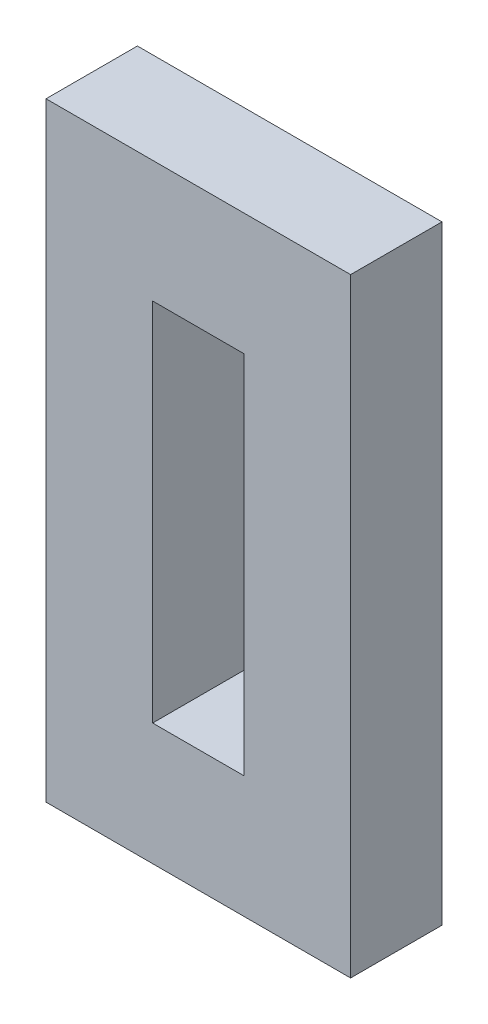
ISO-10303-21;
HEADER;
FILE_DESCRIPTION(('STEP AP214'),'2;1');
FILE_NAME('part.step','',(''),(''),'','','');
FILE_SCHEMA(('AUTOMOTIVE_DESIGN { 1 0 10303 214 1 1 1 1 }'));
ENDSEC;
DATA;
#1=APPLICATION_CONTEXT('core data for automotive mechanical design processes');
#2=APPLICATION_PROTOCOL_DEFINITION('international standard','automotive_design',2000,#1);
#3=PRODUCT_CONTEXT('',#1,'mechanical');
#4=PRODUCT('Part','Part','',(#3));
#5=PRODUCT_RELATED_PRODUCT_CATEGORY('part','',(#4));
#6=PRODUCT_DEFINITION_FORMATION('','',#4);
#7=PRODUCT_DEFINITION_CONTEXT('part definition',#1,'design');
#8=PRODUCT_DEFINITION('design','',#6,#7);
#9=PRODUCT_DEFINITION_SHAPE('','',#8);
#10=(LENGTH_UNIT() NAMED_UNIT(*) SI_UNIT(.MILLI.,.METRE.));
#11=(NAMED_UNIT(*) PLANE_ANGLE_UNIT() SI_UNIT($,.RADIAN.));
#12=(NAMED_UNIT(*) SI_UNIT($,.STERADIAN.) SOLID_ANGLE_UNIT());
#13=UNCERTAINTY_MEASURE_WITH_UNIT(LENGTH_MEASURE(1.E-05),#10,'distance_accuracy_value','');
#14=(GEOMETRIC_REPRESENTATION_CONTEXT(3) GLOBAL_UNCERTAINTY_ASSIGNED_CONTEXT((#13)) GLOBAL_UNIT_ASSIGNED_CONTEXT((#10,
#11,#12)) REPRESENTATION_CONTEXT('',''));
#15=CARTESIAN_POINT('',(0.,0.,0.));
#16=DIRECTION('',(0.,0.,1.));
#17=DIRECTION('',(1.,0.,0.));
#18=AXIS2_PLACEMENT_3D('',#15,#16,#17);
#19=CARTESIAN_POINT('',(0.,20.,3.));
#20=DIRECTION('',(0.,0.,-1.));
#21=DIRECTION('',(-1.,0.,0.));
#22=AXIS2_PLACEMENT_3D('',#19,#20,#21);
#23=PLANE('',#22);
#24=DIRECTION('',(0.,-1.,0.));
#25=VECTOR('',#24,1.);
#26=CARTESIAN_POINT('',(0.,0.,3.));
#27=LINE('',#26,#25);
#28=CARTESIAN_POINT('',(0.,20.,3.));
#29=VERTEX_POINT('',#28);
#30=CARTESIAN_POINT('',(0.,0.,3.));
#31=VERTEX_POINT('',#30);
#32=EDGE_CURVE('E140',#29,#31,#27,.T.);
#33=ORIENTED_EDGE('',*,*,#32,.T.);
#34=DIRECTION('',(1.,0.,0.));
#35=VECTOR('',#34,1.);
#36=CARTESIAN_POINT('',(0.,0.,3.));
#37=LINE('',#36,#35);
#38=CARTESIAN_POINT('',(10.,0.,3.));
#39=VERTEX_POINT('',#38);
#40=EDGE_CURVE('E143',#31,#39,#37,.T.);
#41=ORIENTED_EDGE('',*,*,#40,.T.);
#42=DIRECTION('',(0.,1.,0.));
#43=VECTOR('',#42,1.);
#44=CARTESIAN_POINT('',(10.,0.,3.));
#45=LINE('',#44,#43);
#46=CARTESIAN_POINT('',(10.,20.,3.));
#47=VERTEX_POINT('',#46);
#48=EDGE_CURVE('E145',#39,#47,#45,.T.);
#49=ORIENTED_EDGE('',*,*,#48,.T.);
#50=DIRECTION('',(-1.,0.,0.));
#51=VECTOR('',#50,1.);
#52=CARTESIAN_POINT('',(0.,20.,3.));
#53=LINE('',#52,#51);
#54=EDGE_CURVE('E147',#47,#29,#53,.T.);
#55=ORIENTED_EDGE('',*,*,#54,.T.);
#56=EDGE_LOOP('',(#33,#41,#49,#55));
#57=FACE_BOUND('',#56,.T.);
#58=DIRECTION('',(0.,-1.,0.));
#59=VECTOR('',#58,1.);
#60=CARTESIAN_POINT('',(3.5,16.,3.));
#61=LINE('',#60,#59);
#62=CARTESIAN_POINT('',(3.5,16.,3.));
#63=VERTEX_POINT('',#62);
#64=CARTESIAN_POINT('',(3.5,4.,3.));
#65=VERTEX_POINT('',#64);
#66=EDGE_CURVE('E111',#63,#65,#61,.T.);
#67=ORIENTED_EDGE('',*,*,#66,.F.);
#68=DIRECTION('',(-1.,0.,0.));
#69=VECTOR('',#68,1.);
#70=CARTESIAN_POINT('',(3.5,16.,3.));
#71=LINE('',#70,#69);
#72=CARTESIAN_POINT('',(6.5,16.,3.));
#73=VERTEX_POINT('',#72);
#74=EDGE_CURVE('E126',#73,#63,#71,.T.);
#75=ORIENTED_EDGE('',*,*,#74,.F.);
#76=DIRECTION('',(0.,1.,0.));
#77=VECTOR('',#76,1.);
#78=CARTESIAN_POINT('',(6.5,16.,3.));
#79=LINE('',#78,#77);
#80=CARTESIAN_POINT('',(6.5,4.,3.));
#81=VERTEX_POINT('',#80);
#82=EDGE_CURVE('E124',#81,#73,#79,.T.);
#83=ORIENTED_EDGE('',*,*,#82,.F.);
#84=DIRECTION('',(1.,0.,0.));
#85=VECTOR('',#84,1.);
#86=CARTESIAN_POINT('',(3.5,4.,3.));
#87=LINE('',#86,#85);
#88=EDGE_CURVE('E122',#65,#81,#87,.T.);
#89=ORIENTED_EDGE('',*,*,#88,.F.);
#90=EDGE_LOOP('',(#67,#75,#83,#89));
#91=FACE_BOUND('',#90,.T.);
#92=ADVANCED_FACE('F31',(#57,#91),#23,.F.);
#93=CARTESIAN_POINT('',(0.,20.,0.));
#94=DIRECTION('',(0.,0.,-1.));
#95=DIRECTION('',(-1.,0.,0.));
#96=AXIS2_PLACEMENT_3D('',#93,#94,#95);
#97=PLANE('',#96);
#98=DIRECTION('',(0.,-1.,0.));
#99=VECTOR('',#98,1.);
#100=CARTESIAN_POINT('',(0.,0.,0.));
#101=LINE('',#100,#99);
#102=CARTESIAN_POINT('',(0.,20.,0.));
#103=VERTEX_POINT('',#102);
#104=CARTESIAN_POINT('',(0.,0.,0.));
#105=VERTEX_POINT('',#104);
#106=EDGE_CURVE('E112',#103,#105,#101,.T.);
#107=ORIENTED_EDGE('',*,*,#106,.F.);
#108=DIRECTION('',(-1.,0.,0.));
#109=VECTOR('',#108,1.);
#110=CARTESIAN_POINT('',(0.,20.,0.));
#111=LINE('',#110,#109);
#112=CARTESIAN_POINT('',(10.,20.,0.));
#113=VERTEX_POINT('',#112);
#114=EDGE_CURVE('E138',#113,#103,#111,.T.);
#115=ORIENTED_EDGE('',*,*,#114,.F.);
#116=DIRECTION('',(0.,1.,0.));
#117=VECTOR('',#116,1.);
#118=CARTESIAN_POINT('',(10.,0.,0.));
#119=LINE('',#118,#117);
#120=CARTESIAN_POINT('',(10.,0.,0.));
#121=VERTEX_POINT('',#120);
#122=EDGE_CURVE('E136',#121,#113,#119,.T.);
#123=ORIENTED_EDGE('',*,*,#122,.F.);
#124=DIRECTION('',(1.,0.,0.));
#125=VECTOR('',#124,1.);
#126=CARTESIAN_POINT('',(0.,0.,0.));
#127=LINE('',#126,#125);
#128=EDGE_CURVE('E134',#105,#121,#127,.T.);
#129=ORIENTED_EDGE('',*,*,#128,.F.);
#130=EDGE_LOOP('',(#107,#115,#123,#129));
#131=FACE_BOUND('',#130,.T.);
#132=DIRECTION('',(-1.,0.,0.));
#133=VECTOR('',#132,1.);
#134=CARTESIAN_POINT('',(3.5,16.,0.));
#135=LINE('',#134,#133);
#136=CARTESIAN_POINT('',(6.5,16.,0.));
#137=VERTEX_POINT('',#136);
#138=CARTESIAN_POINT('',(3.5,16.,0.));
#139=VERTEX_POINT('',#138);
#140=EDGE_CURVE('E116',#137,#139,#135,.T.);
#141=ORIENTED_EDGE('',*,*,#140,.T.);
#142=DIRECTION('',(0.,-1.,0.));
#143=VECTOR('',#142,1.);
#144=CARTESIAN_POINT('',(3.5,16.,0.));
#145=LINE('',#144,#143);
#146=CARTESIAN_POINT('',(3.5,4.,0.));
#147=VERTEX_POINT('',#146);
#148=EDGE_CURVE('E54',#139,#147,#145,.T.);
#149=ORIENTED_EDGE('',*,*,#148,.T.);
#150=DIRECTION('',(1.,0.,0.));
#151=VECTOR('',#150,1.);
#152=CARTESIAN_POINT('',(3.5,4.,0.));
#153=LINE('',#152,#151);
#154=CARTESIAN_POINT('',(6.5,4.,0.));
#155=VERTEX_POINT('',#154);
#156=EDGE_CURVE('E98',#147,#155,#153,.T.);
#157=ORIENTED_EDGE('',*,*,#156,.T.);
#158=DIRECTION('',(0.,1.,0.));
#159=VECTOR('',#158,1.);
#160=CARTESIAN_POINT('',(6.5,16.,0.));
#161=LINE('',#160,#159);
#162=EDGE_CURVE('E107',#155,#137,#161,.T.);
#163=ORIENTED_EDGE('',*,*,#162,.T.);
#164=EDGE_LOOP('',(#141,#149,#157,#163));
#165=FACE_BOUND('',#164,.T.);
#166=ADVANCED_FACE('F115',(#131,#165),#97,.T.);
#167=CARTESIAN_POINT('',(0.,0.,3.));
#168=DIRECTION('',(1.,0.,0.));
#169=DIRECTION('',(0.,0.,-1.));
#170=AXIS2_PLACEMENT_3D('',#167,#168,#169);
#171=PLANE('',#170);
#172=ORIENTED_EDGE('',*,*,#106,.T.);
#173=DIRECTION('',(0.,0.,-1.));
#174=VECTOR('',#173,1.);
#175=CARTESIAN_POINT('',(0.,0.,3.));
#176=LINE('',#175,#174);
#177=EDGE_CURVE('E11',#31,#105,#176,.T.);
#178=ORIENTED_EDGE('',*,*,#177,.F.);
#179=ORIENTED_EDGE('',*,*,#32,.F.);
#180=DIRECTION('',(0.,0.,-1.));
#181=VECTOR('',#180,1.);
#182=CARTESIAN_POINT('',(0.,20.,3.));
#183=LINE('',#182,#181);
#184=EDGE_CURVE('E149',#29,#103,#183,.T.);
#185=ORIENTED_EDGE('',*,*,#184,.T.);
#186=EDGE_LOOP('',(#172,#178,#179,#185));
#187=FACE_BOUND('',#186,.T.);
#188=ADVANCED_FACE('F33',(#187),#171,.F.);
#189=CARTESIAN_POINT('',(0.,0.,3.));
#190=DIRECTION('',(0.,1.,0.));
#191=DIRECTION('',(0.,0.,1.));
#192=AXIS2_PLACEMENT_3D('',#189,#190,#191);
#193=PLANE('',#192);
#194=ORIENTED_EDGE('',*,*,#128,.T.);
#195=DIRECTION('',(0.,0.,-1.));
#196=VECTOR('',#195,1.);
#197=CARTESIAN_POINT('',(10.,0.,3.));
#198=LINE('',#197,#196);
#199=EDGE_CURVE('E39',#39,#121,#198,.T.);
#200=ORIENTED_EDGE('',*,*,#199,.F.);
#201=ORIENTED_EDGE('',*,*,#40,.F.);
#202=ORIENTED_EDGE('',*,*,#177,.T.);
#203=EDGE_LOOP('',(#194,#200,#201,#202));
#204=FACE_BOUND('',#203,.T.);
#205=ADVANCED_FACE('F174',(#204),#193,.F.);
#206=CARTESIAN_POINT('',(10.,0.,3.));
#207=DIRECTION('',(-1.,0.,0.));
#208=DIRECTION('',(0.,0.,1.));
#209=AXIS2_PLACEMENT_3D('',#206,#207,#208);
#210=PLANE('',#209);
#211=ORIENTED_EDGE('',*,*,#122,.T.);
#212=DIRECTION('',(0.,0.,-1.));
#213=VECTOR('',#212,1.);
#214=CARTESIAN_POINT('',(10.,20.,3.));
#215=LINE('',#214,#213);
#216=EDGE_CURVE('E152',#47,#113,#215,.T.);
#217=ORIENTED_EDGE('',*,*,#216,.F.);
#218=ORIENTED_EDGE('',*,*,#48,.F.);
#219=ORIENTED_EDGE('',*,*,#199,.T.);
#220=EDGE_LOOP('',(#211,#217,#218,#219));
#221=FACE_BOUND('',#220,.T.);
#222=ADVANCED_FACE('F159',(#221),#210,.F.);
#223=CARTESIAN_POINT('',(0.,20.,3.));
#224=DIRECTION('',(0.,-1.,0.));
#225=DIRECTION('',(0.,0.,-1.));
#226=AXIS2_PLACEMENT_3D('',#223,#224,#225);
#227=PLANE('',#226);
#228=ORIENTED_EDGE('',*,*,#114,.T.);
#229=ORIENTED_EDGE('',*,*,#184,.F.);
#230=ORIENTED_EDGE('',*,*,#54,.F.);
#231=ORIENTED_EDGE('',*,*,#216,.T.);
#232=EDGE_LOOP('',(#228,#229,#230,#231));
#233=FACE_BOUND('',#232,.T.);
#234=ADVANCED_FACE('F167',(#233),#227,.F.);
#235=CARTESIAN_POINT('',(3.5,16.,3.));
#236=DIRECTION('',(1.,0.,0.));
#237=DIRECTION('',(0.,0.,-1.));
#238=AXIS2_PLACEMENT_3D('',#235,#236,#237);
#239=PLANE('',#238);
#240=ORIENTED_EDGE('',*,*,#148,.F.);
#241=DIRECTION('',(0.,0.,-1.));
#242=VECTOR('',#241,1.);
#243=CARTESIAN_POINT('',(3.5,16.,3.));
#244=LINE('',#243,#242);
#245=EDGE_CURVE('E128',#63,#139,#244,.T.);
#246=ORIENTED_EDGE('',*,*,#245,.F.);
#247=ORIENTED_EDGE('',*,*,#66,.T.);
#248=DIRECTION('',(0.,0.,-1.));
#249=VECTOR('',#248,1.);
#250=CARTESIAN_POINT('',(3.5,4.,3.));
#251=LINE('',#250,#249);
#252=EDGE_CURVE('E100',#65,#147,#251,.T.);
#253=ORIENTED_EDGE('',*,*,#252,.T.);
#254=EDGE_LOOP('',(#240,#246,#247,#253));
#255=FACE_BOUND('',#254,.T.);
#256=ADVANCED_FACE('F109',(#255),#239,.T.);
#257=CARTESIAN_POINT('',(3.5,4.,3.));
#258=DIRECTION('',(0.,1.,0.));
#259=DIRECTION('',(0.,0.,1.));
#260=AXIS2_PLACEMENT_3D('',#257,#258,#259);
#261=PLANE('',#260);
#262=ORIENTED_EDGE('',*,*,#156,.F.);
#263=ORIENTED_EDGE('',*,*,#252,.F.);
#264=ORIENTED_EDGE('',*,*,#88,.T.);
#265=DIRECTION('',(0.,0.,-1.));
#266=VECTOR('',#265,1.);
#267=CARTESIAN_POINT('',(6.5,4.,3.));
#268=LINE('',#267,#266);
#269=EDGE_CURVE('E103',#81,#155,#268,.T.);
#270=ORIENTED_EDGE('',*,*,#269,.T.);
#271=EDGE_LOOP('',(#262,#263,#264,#270));
#272=FACE_BOUND('',#271,.T.);
#273=ADVANCED_FACE('F99',(#272),#261,.T.);
#274=CARTESIAN_POINT('',(6.5,16.,3.));
#275=DIRECTION('',(-1.,0.,0.));
#276=DIRECTION('',(0.,0.,1.));
#277=AXIS2_PLACEMENT_3D('',#274,#275,#276);
#278=PLANE('',#277);
#279=ORIENTED_EDGE('',*,*,#162,.F.);
#280=ORIENTED_EDGE('',*,*,#269,.F.);
#281=ORIENTED_EDGE('',*,*,#82,.T.);
#282=DIRECTION('',(0.,0.,-1.));
#283=VECTOR('',#282,1.);
#284=CARTESIAN_POINT('',(6.5,16.,3.));
#285=LINE('',#284,#283);
#286=EDGE_CURVE('E46',#73,#137,#285,.T.);
#287=ORIENTED_EDGE('',*,*,#286,.T.);
#288=EDGE_LOOP('',(#279,#280,#281,#287));
#289=FACE_BOUND('',#288,.T.);
#290=ADVANCED_FACE('F196',(#289),#278,.T.);
#291=CARTESIAN_POINT('',(3.5,16.,3.));
#292=DIRECTION('',(0.,-1.,0.));
#293=DIRECTION('',(0.,0.,-1.));
#294=AXIS2_PLACEMENT_3D('',#291,#292,#293);
#295=PLANE('',#294);
#296=ORIENTED_EDGE('',*,*,#140,.F.);
#297=ORIENTED_EDGE('',*,*,#286,.F.);
#298=ORIENTED_EDGE('',*,*,#74,.T.);
#299=ORIENTED_EDGE('',*,*,#245,.T.);
#300=EDGE_LOOP('',(#296,#297,#298,#299));
#301=FACE_BOUND('',#300,.T.);
#302=ADVANCED_FACE('F201',(#301),#295,.T.);
#303=CLOSED_SHELL('',(#92,#166,#188,#205,#222,#234,#256,#273,#290,#302));
#304=MANIFOLD_SOLID_BREP('B2',#303);
#305=ADVANCED_BREP_SHAPE_REPRESENTATION('',(#18,#304),#14);
#306=SHAPE_DEFINITION_REPRESENTATION(#9,#305);
ENDSEC;
END-ISO-10303-21;
